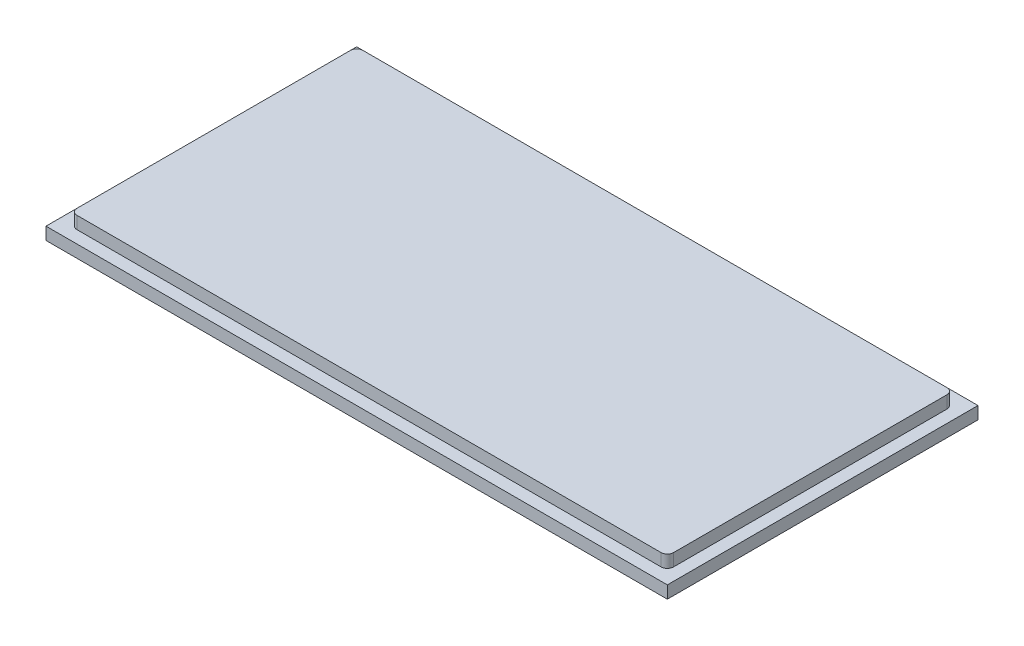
ISO-10303-21;
HEADER;
FILE_DESCRIPTION(('STEP AP214'),'2;1');
FILE_NAME('part.step','',(''),(''),'','','');
FILE_SCHEMA(('AUTOMOTIVE_DESIGN { 1 0 10303 214 1 1 1 1 }'));
ENDSEC;
DATA;
#1=APPLICATION_CONTEXT('core data for automotive mechanical design processes');
#2=APPLICATION_PROTOCOL_DEFINITION('international standard','automotive_design',2000,#1);
#3=PRODUCT_CONTEXT('',#1,'mechanical');
#4=PRODUCT('Part','Part','',(#3));
#5=PRODUCT_RELATED_PRODUCT_CATEGORY('part','',(#4));
#6=PRODUCT_DEFINITION_FORMATION('','',#4);
#7=PRODUCT_DEFINITION_CONTEXT('part definition',#1,'design');
#8=PRODUCT_DEFINITION('design','',#6,#7);
#9=PRODUCT_DEFINITION_SHAPE('','',#8);
#10=(LENGTH_UNIT() NAMED_UNIT(*) SI_UNIT(.MILLI.,.METRE.));
#11=(NAMED_UNIT(*) PLANE_ANGLE_UNIT() SI_UNIT($,.RADIAN.));
#12=(NAMED_UNIT(*) SI_UNIT($,.STERADIAN.) SOLID_ANGLE_UNIT());
#13=UNCERTAINTY_MEASURE_WITH_UNIT(LENGTH_MEASURE(1.E-05),#10,'distance_accuracy_value','');
#14=(GEOMETRIC_REPRESENTATION_CONTEXT(3) GLOBAL_UNCERTAINTY_ASSIGNED_CONTEXT((#13)) GLOBAL_UNIT_ASSIGNED_CONTEXT((#10,
#11,#12)) REPRESENTATION_CONTEXT('',''));
#15=CARTESIAN_POINT('',(0.,0.,0.));
#16=DIRECTION('',(0.,0.,1.));
#17=DIRECTION('',(1.,0.,0.));
#18=AXIS2_PLACEMENT_3D('',#15,#16,#17);
#19=CARTESIAN_POINT('',(0.,2.54,0.));
#20=DIRECTION('',(1.,0.,0.));
#21=DIRECTION('',(0.,0.,-1.));
#22=AXIS2_PLACEMENT_3D('',#19,#20,#21);
#23=PLANE('',#22);
#24=DIRECTION('',(0.,0.,1.));
#25=VECTOR('',#24,1.);
#26=CARTESIAN_POINT('',(0.,0.,0.));
#27=LINE('',#26,#25);
#28=CARTESIAN_POINT('',(0.,0.,-63.5));
#29=VERTEX_POINT('',#28);
#30=CARTESIAN_POINT('',(0.,0.,0.));
#31=VERTEX_POINT('',#30);
#32=EDGE_CURVE('E158',#29,#31,#27,.T.);
#33=ORIENTED_EDGE('',*,*,#32,.T.);
#34=DIRECTION('',(0.,-1.,0.));
#35=VECTOR('',#34,1.);
#36=CARTESIAN_POINT('',(0.,2.54,0.));
#37=LINE('',#36,#35);
#38=CARTESIAN_POINT('',(0.,2.54,0.));
#39=VERTEX_POINT('',#38);
#40=EDGE_CURVE('E11',#39,#31,#37,.T.);
#41=ORIENTED_EDGE('',*,*,#40,.F.);
#42=DIRECTION('',(0.,0.,1.));
#43=VECTOR('',#42,1.);
#44=CARTESIAN_POINT('',(0.,2.54,0.));
#45=LINE('',#44,#43);
#46=CARTESIAN_POINT('',(0.,2.54,-63.5));
#47=VERTEX_POINT('',#46);
#48=EDGE_CURVE('E169',#47,#39,#45,.T.);
#49=ORIENTED_EDGE('',*,*,#48,.F.);
#50=DIRECTION('',(0.,-1.,0.));
#51=VECTOR('',#50,1.);
#52=CARTESIAN_POINT('',(0.,2.54,-63.5));
#53=LINE('',#52,#51);
#54=EDGE_CURVE('E182',#47,#29,#53,.T.);
#55=ORIENTED_EDGE('',*,*,#54,.T.);
#56=EDGE_LOOP('',(#33,#41,#49,#55));
#57=FACE_BOUND('',#56,.T.);
#58=ADVANCED_FACE('F45',(#57),#23,.F.);
#59=CARTESIAN_POINT('',(0.,2.54,0.));
#60=DIRECTION('',(0.,0.,-1.));
#61=DIRECTION('',(-1.,0.,0.));
#62=AXIS2_PLACEMENT_3D('',#59,#60,#61);
#63=PLANE('',#62);
#64=DIRECTION('',(1.,0.,0.));
#65=VECTOR('',#64,1.);
#66=CARTESIAN_POINT('',(0.,0.,0.));
#67=LINE('',#66,#65);
#68=CARTESIAN_POINT('',(127.,0.,0.));
#69=VERTEX_POINT('',#68);
#70=EDGE_CURVE('E163',#31,#69,#67,.T.);
#71=ORIENTED_EDGE('',*,*,#70,.T.);
#72=DIRECTION('',(0.,-1.,0.));
#73=VECTOR('',#72,1.);
#74=CARTESIAN_POINT('',(127.,2.54,0.));
#75=LINE('',#74,#73);
#76=CARTESIAN_POINT('',(127.,2.54,0.));
#77=VERTEX_POINT('',#76);
#78=EDGE_CURVE('E53',#77,#69,#75,.T.);
#79=ORIENTED_EDGE('',*,*,#78,.F.);
#80=DIRECTION('',(1.,0.,0.));
#81=VECTOR('',#80,1.);
#82=CARTESIAN_POINT('',(0.,2.54,0.));
#83=LINE('',#82,#81);
#84=EDGE_CURVE('E173',#39,#77,#83,.T.);
#85=ORIENTED_EDGE('',*,*,#84,.F.);
#86=ORIENTED_EDGE('',*,*,#40,.T.);
#87=EDGE_LOOP('',(#71,#79,#85,#86));
#88=FACE_BOUND('',#87,.T.);
#89=ADVANCED_FACE('F219',(#88),#63,.F.);
#90=CARTESIAN_POINT('',(127.,2.54,0.));
#91=DIRECTION('',(-1.,0.,0.));
#92=DIRECTION('',(0.,0.,1.));
#93=AXIS2_PLACEMENT_3D('',#90,#91,#92);
#94=PLANE('',#93);
#95=DIRECTION('',(0.,0.,-1.));
#96=VECTOR('',#95,1.);
#97=CARTESIAN_POINT('',(127.,0.,0.));
#98=LINE('',#97,#96);
#99=CARTESIAN_POINT('',(127.,0.,-63.5));
#100=VERTEX_POINT('',#99);
#101=EDGE_CURVE('E186',#69,#100,#98,.T.);
#102=ORIENTED_EDGE('',*,*,#101,.T.);
#103=DIRECTION('',(0.,-1.,0.));
#104=VECTOR('',#103,1.);
#105=CARTESIAN_POINT('',(127.,2.54,-63.5));
#106=LINE('',#105,#104);
#107=CARTESIAN_POINT('',(127.,2.54,-63.5));
#108=VERTEX_POINT('',#107);
#109=EDGE_CURVE('E194',#108,#100,#106,.T.);
#110=ORIENTED_EDGE('',*,*,#109,.F.);
#111=DIRECTION('',(0.,0.,-1.));
#112=VECTOR('',#111,1.);
#113=CARTESIAN_POINT('',(127.,2.54,0.));
#114=LINE('',#113,#112);
#115=EDGE_CURVE('E177',#77,#108,#114,.T.);
#116=ORIENTED_EDGE('',*,*,#115,.F.);
#117=ORIENTED_EDGE('',*,*,#78,.T.);
#118=EDGE_LOOP('',(#102,#110,#116,#117));
#119=FACE_BOUND('',#118,.T.);
#120=ADVANCED_FACE('F203',(#119),#94,.F.);
#121=CARTESIAN_POINT('',(0.,2.54,-63.5));
#122=DIRECTION('',(0.,0.,1.));
#123=DIRECTION('',(1.,0.,0.));
#124=AXIS2_PLACEMENT_3D('',#121,#122,#123);
#125=PLANE('',#124);
#126=DIRECTION('',(-1.,0.,0.));
#127=VECTOR('',#126,1.);
#128=CARTESIAN_POINT('',(0.,0.,-63.5));
#129=LINE('',#128,#127);
#130=EDGE_CURVE('E174',#100,#29,#129,.T.);
#131=ORIENTED_EDGE('',*,*,#130,.T.);
#132=ORIENTED_EDGE('',*,*,#54,.F.);
#133=DIRECTION('',(-1.,0.,0.));
#134=VECTOR('',#133,1.);
#135=CARTESIAN_POINT('',(0.,2.54,-63.5));
#136=LINE('',#135,#134);
#137=EDGE_CURVE('E180',#108,#47,#136,.T.);
#138=ORIENTED_EDGE('',*,*,#137,.F.);
#139=ORIENTED_EDGE('',*,*,#109,.T.);
#140=EDGE_LOOP('',(#131,#132,#138,#139));
#141=FACE_BOUND('',#140,.T.);
#142=ADVANCED_FACE('F212',(#141),#125,.F.);
#143=CARTESIAN_POINT('',(0.,2.54,0.));
#144=DIRECTION('',(0.,-1.,0.));
#145=DIRECTION('',(0.,0.,-1.));
#146=AXIS2_PLACEMENT_3D('',#143,#144,#145);
#147=PLANE('',#146);
#148=DIRECTION('',(0.,0.,-1.));
#149=VECTOR('',#148,1.);
#150=CARTESIAN_POINT('',(124.46,2.54,0.));
#151=LINE('',#150,#149);
#152=CARTESIAN_POINT('',(124.46,2.54,-3.81000000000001));
#153=VERTEX_POINT('',#152);
#154=CARTESIAN_POINT('',(124.46,2.54,-59.69));
#155=VERTEX_POINT('',#154);
#156=EDGE_CURVE('E60',#153,#155,#151,.T.);
#157=ORIENTED_EDGE('',*,*,#156,.F.);
#158=CARTESIAN_POINT('',(123.19,2.54,-3.81));
#159=DIRECTION('',(0.,1.,0.));
#160=DIRECTION('',(0.,0.,1.));
#161=AXIS2_PLACEMENT_3D('',#158,#159,#160);
#162=CIRCLE('',#161,1.27);
#163=CARTESIAN_POINT('',(123.19,2.54,-2.54));
#164=VERTEX_POINT('',#163);
#165=EDGE_CURVE('E65',#153,#164,#162,.F.);
#166=ORIENTED_EDGE('',*,*,#165,.T.);
#167=DIRECTION('',(1.,0.,0.));
#168=VECTOR('',#167,1.);
#169=CARTESIAN_POINT('',(0.,2.54,-2.54));
#170=LINE('',#169,#168);
#171=CARTESIAN_POINT('',(3.81000000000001,2.54,-2.54));
#172=VERTEX_POINT('',#171);
#173=EDGE_CURVE('E385',#172,#164,#170,.T.);
#174=ORIENTED_EDGE('',*,*,#173,.F.);
#175=CARTESIAN_POINT('',(3.81,2.54,-3.81));
#176=DIRECTION('',(0.,1.,0.));
#177=DIRECTION('',(0.,0.,1.));
#178=AXIS2_PLACEMENT_3D('',#175,#176,#177);
#179=CIRCLE('',#178,1.27);
#180=CARTESIAN_POINT('',(2.54,2.54,-3.81000000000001));
#181=VERTEX_POINT('',#180);
#182=EDGE_CURVE('E388',#172,#181,#179,.F.);
#183=ORIENTED_EDGE('',*,*,#182,.T.);
#184=DIRECTION('',(0.,0.,-1.));
#185=VECTOR('',#184,1.);
#186=CARTESIAN_POINT('',(2.54,2.54,0.));
#187=LINE('',#186,#185);
#188=CARTESIAN_POINT('',(2.54,2.54,-59.69));
#189=VERTEX_POINT('',#188);
#190=EDGE_CURVE('E421',#181,#189,#187,.T.);
#191=ORIENTED_EDGE('',*,*,#190,.T.);
#192=CARTESIAN_POINT('',(3.81,2.54,-59.69));
#193=DIRECTION('',(0.,1.,0.));
#194=DIRECTION('',(0.,0.,1.));
#195=AXIS2_PLACEMENT_3D('',#192,#193,#194);
#196=CIRCLE('',#195,1.27);
#197=CARTESIAN_POINT('',(3.81000000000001,2.54,-60.96));
#198=VERTEX_POINT('',#197);
#199=EDGE_CURVE('E412',#189,#198,#196,.F.);
#200=ORIENTED_EDGE('',*,*,#199,.T.);
#201=DIRECTION('',(1.,0.,0.));
#202=VECTOR('',#201,1.);
#203=CARTESIAN_POINT('',(0.,2.54,-60.96));
#204=LINE('',#203,#202);
#205=CARTESIAN_POINT('',(123.19,2.54,-60.96));
#206=VERTEX_POINT('',#205);
#207=EDGE_CURVE('E415',#198,#206,#204,.T.);
#208=ORIENTED_EDGE('',*,*,#207,.T.);
#209=CARTESIAN_POINT('',(123.19,2.54,-59.69));
#210=DIRECTION('',(0.,1.,0.));
#211=DIRECTION('',(0.,0.,1.));
#212=AXIS2_PLACEMENT_3D('',#209,#210,#211);
#213=CIRCLE('',#212,1.27);
#214=EDGE_CURVE('E417',#155,#206,#213,.T.);
#215=ORIENTED_EDGE('',*,*,#214,.F.);
#216=EDGE_LOOP('',(#157,#166,#174,#183,#191,#200,#208,#215));
#217=FACE_BOUND('',#216,.T.);
#218=ORIENTED_EDGE('',*,*,#48,.T.);
#219=ORIENTED_EDGE('',*,*,#84,.T.);
#220=ORIENTED_EDGE('',*,*,#115,.T.);
#221=ORIENTED_EDGE('',*,*,#137,.T.);
#222=EDGE_LOOP('',(#218,#219,#220,#221));
#223=FACE_BOUND('',#222,.T.);
#224=ADVANCED_FACE('F218',(#217,#223),#147,.F.);
#225=CARTESIAN_POINT('',(0.,0.,0.));
#226=DIRECTION('',(0.,-1.,0.));
#227=DIRECTION('',(0.,0.,-1.));
#228=AXIS2_PLACEMENT_3D('',#225,#226,#227);
#229=PLANE('',#228);
#230=ORIENTED_EDGE('',*,*,#32,.F.);
#231=ORIENTED_EDGE('',*,*,#130,.F.);
#232=ORIENTED_EDGE('',*,*,#101,.F.);
#233=ORIENTED_EDGE('',*,*,#70,.F.);
#234=EDGE_LOOP('',(#230,#231,#232,#233));
#235=FACE_BOUND('',#234,.T.);
#236=ADVANCED_FACE('F209',(#235),#229,.T.);
#237=CARTESIAN_POINT('',(124.46,5.08,0.));
#238=DIRECTION('',(-1.,0.,0.));
#239=DIRECTION('',(0.,0.,1.));
#240=AXIS2_PLACEMENT_3D('',#237,#238,#239);
#241=PLANE('',#240);
#242=ORIENTED_EDGE('',*,*,#156,.T.);
#243=DIRECTION('',(0.,-1.,0.));
#244=VECTOR('',#243,1.);
#245=CARTESIAN_POINT('',(124.46,5.08,-59.69));
#246=LINE('',#245,#244);
#247=CARTESIAN_POINT('',(124.46,5.08,-59.69));
#248=VERTEX_POINT('',#247);
#249=EDGE_CURVE('E138',#248,#155,#246,.T.);
#250=ORIENTED_EDGE('',*,*,#249,.F.);
#251=DIRECTION('',(0.,0.,-1.));
#252=VECTOR('',#251,1.);
#253=CARTESIAN_POINT('',(124.46,5.08,0.));
#254=LINE('',#253,#252);
#255=CARTESIAN_POINT('',(124.46,5.08,-3.81000000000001));
#256=VERTEX_POINT('',#255);
#257=EDGE_CURVE('E146',#256,#248,#254,.T.);
#258=ORIENTED_EDGE('',*,*,#257,.F.);
#259=DIRECTION('',(0.,-1.,0.));
#260=VECTOR('',#259,1.);
#261=CARTESIAN_POINT('',(124.46,5.08,-3.81000000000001));
#262=LINE('',#261,#260);
#263=EDGE_CURVE('E380',#256,#153,#262,.T.);
#264=ORIENTED_EDGE('',*,*,#263,.T.);
#265=EDGE_LOOP('',(#242,#250,#258,#264));
#266=FACE_BOUND('',#265,.T.);
#267=ADVANCED_FACE('F156',(#266),#241,.F.);
#268=CARTESIAN_POINT('',(123.19,5.08,-59.69));
#269=DIRECTION('',(0.,-1.,0.));
#270=DIRECTION('',(0.,0.,-1.));
#271=AXIS2_PLACEMENT_3D('',#268,#269,#270);
#272=CYLINDRICAL_SURFACE('',#271,1.27);
#273=ORIENTED_EDGE('',*,*,#214,.T.);
#274=DIRECTION('',(0.,-1.,0.));
#275=VECTOR('',#274,1.);
#276=CARTESIAN_POINT('',(123.19,5.08,-60.96));
#277=LINE('',#276,#275);
#278=CARTESIAN_POINT('',(123.19,5.08,-60.96));
#279=VERTEX_POINT('',#278);
#280=EDGE_CURVE('E140',#279,#206,#277,.T.);
#281=ORIENTED_EDGE('',*,*,#280,.F.);
#282=CARTESIAN_POINT('',(123.19,5.08,-59.69));
#283=DIRECTION('',(0.,1.,0.));
#284=DIRECTION('',(0.,0.,1.));
#285=AXIS2_PLACEMENT_3D('',#282,#283,#284);
#286=CIRCLE('',#285,1.27);
#287=EDGE_CURVE('E133',#248,#279,#286,.T.);
#288=ORIENTED_EDGE('',*,*,#287,.F.);
#289=ORIENTED_EDGE('',*,*,#249,.T.);
#290=EDGE_LOOP('',(#273,#281,#288,#289));
#291=FACE_BOUND('',#290,.T.);
#292=ADVANCED_FACE('F136',(#291),#272,.T.);
#293=CARTESIAN_POINT('',(0.,5.08,-60.96));
#294=DIRECTION('',(0.,0.,-1.));
#295=DIRECTION('',(-1.,0.,0.));
#296=AXIS2_PLACEMENT_3D('',#293,#294,#295);
#297=PLANE('',#296);
#298=ORIENTED_EDGE('',*,*,#207,.F.);
#299=DIRECTION('',(0.,-1.,0.));
#300=VECTOR('',#299,1.);
#301=CARTESIAN_POINT('',(3.81000000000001,5.08,-60.96));
#302=LINE('',#301,#300);
#303=CARTESIAN_POINT('',(3.81000000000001,5.08,-60.96));
#304=VERTEX_POINT('',#303);
#305=EDGE_CURVE('E165',#304,#198,#302,.T.);
#306=ORIENTED_EDGE('',*,*,#305,.F.);
#307=DIRECTION('',(1.,0.,0.));
#308=VECTOR('',#307,1.);
#309=CARTESIAN_POINT('',(0.,5.08,-60.96));
#310=LINE('',#309,#308);
#311=EDGE_CURVE('E145',#304,#279,#310,.T.);
#312=ORIENTED_EDGE('',*,*,#311,.T.);
#313=ORIENTED_EDGE('',*,*,#280,.T.);
#314=EDGE_LOOP('',(#298,#306,#312,#313));
#315=FACE_BOUND('',#314,.T.);
#316=ADVANCED_FACE('F237',(#315),#297,.T.);
#317=CARTESIAN_POINT('',(3.81,5.08,-59.69));
#318=DIRECTION('',(0.,-1.,0.));
#319=DIRECTION('',(0.,0.,-1.));
#320=AXIS2_PLACEMENT_3D('',#317,#318,#319);
#321=CYLINDRICAL_SURFACE('',#320,1.27);
#322=ORIENTED_EDGE('',*,*,#199,.F.);
#323=DIRECTION('',(0.,-1.,0.));
#324=VECTOR('',#323,1.);
#325=CARTESIAN_POINT('',(2.54,5.08,-59.69));
#326=LINE('',#325,#324);
#327=CARTESIAN_POINT('',(2.54,5.08,-59.69));
#328=VERTEX_POINT('',#327);
#329=EDGE_CURVE('E404',#328,#189,#326,.T.);
#330=ORIENTED_EDGE('',*,*,#329,.F.);
#331=CARTESIAN_POINT('',(3.81,5.08,-59.69));
#332=DIRECTION('',(0.,1.,0.));
#333=DIRECTION('',(0.,0.,1.));
#334=AXIS2_PLACEMENT_3D('',#331,#332,#333);
#335=CIRCLE('',#334,1.27);
#336=EDGE_CURVE('E414',#328,#304,#335,.F.);
#337=ORIENTED_EDGE('',*,*,#336,.T.);
#338=ORIENTED_EDGE('',*,*,#305,.T.);
#339=EDGE_LOOP('',(#322,#330,#337,#338));
#340=FACE_BOUND('',#339,.T.);
#341=ADVANCED_FACE('F240',(#340),#321,.T.);
#342=CARTESIAN_POINT('',(2.54,5.08,0.));
#343=DIRECTION('',(-1.,0.,0.));
#344=DIRECTION('',(0.,0.,1.));
#345=AXIS2_PLACEMENT_3D('',#342,#343,#344);
#346=PLANE('',#345);
#347=ORIENTED_EDGE('',*,*,#190,.F.);
#348=DIRECTION('',(0.,-1.,0.));
#349=VECTOR('',#348,1.);
#350=CARTESIAN_POINT('',(2.54,5.08,-3.81000000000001));
#351=LINE('',#350,#349);
#352=CARTESIAN_POINT('',(2.54,5.08,-3.81000000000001));
#353=VERTEX_POINT('',#352);
#354=EDGE_CURVE('E400',#353,#181,#351,.T.);
#355=ORIENTED_EDGE('',*,*,#354,.F.);
#356=DIRECTION('',(0.,0.,-1.));
#357=VECTOR('',#356,1.);
#358=CARTESIAN_POINT('',(2.54,5.08,0.));
#359=LINE('',#358,#357);
#360=EDGE_CURVE('E435',#353,#328,#359,.T.);
#361=ORIENTED_EDGE('',*,*,#360,.T.);
#362=ORIENTED_EDGE('',*,*,#329,.T.);
#363=EDGE_LOOP('',(#347,#355,#361,#362));
#364=FACE_BOUND('',#363,.T.);
#365=ADVANCED_FACE('F244',(#364),#346,.T.);
#366=CARTESIAN_POINT('',(3.81,5.08,-3.81));
#367=DIRECTION('',(0.,-1.,0.));
#368=DIRECTION('',(0.,0.,-1.));
#369=AXIS2_PLACEMENT_3D('',#366,#367,#368);
#370=CYLINDRICAL_SURFACE('',#369,1.27);
#371=ORIENTED_EDGE('',*,*,#182,.F.);
#372=DIRECTION('',(0.,-1.,0.));
#373=VECTOR('',#372,1.);
#374=CARTESIAN_POINT('',(3.81000000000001,5.08,-2.54));
#375=LINE('',#374,#373);
#376=CARTESIAN_POINT('',(3.81000000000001,5.08,-2.54));
#377=VERTEX_POINT('',#376);
#378=EDGE_CURVE('E396',#377,#172,#375,.T.);
#379=ORIENTED_EDGE('',*,*,#378,.F.);
#380=CARTESIAN_POINT('',(3.81,5.08,-3.81));
#381=DIRECTION('',(0.,1.,0.));
#382=DIRECTION('',(0.,0.,1.));
#383=AXIS2_PLACEMENT_3D('',#380,#381,#382);
#384=CIRCLE('',#383,1.27);
#385=EDGE_CURVE('E432',#377,#353,#384,.F.);
#386=ORIENTED_EDGE('',*,*,#385,.T.);
#387=ORIENTED_EDGE('',*,*,#354,.T.);
#388=EDGE_LOOP('',(#371,#379,#386,#387));
#389=FACE_BOUND('',#388,.T.);
#390=ADVANCED_FACE('F248',(#389),#370,.T.);
#391=CARTESIAN_POINT('',(0.,5.08,-2.54));
#392=DIRECTION('',(0.,0.,-1.));
#393=DIRECTION('',(-1.,0.,0.));
#394=AXIS2_PLACEMENT_3D('',#391,#392,#393);
#395=PLANE('',#394);
#396=ORIENTED_EDGE('',*,*,#173,.T.);
#397=DIRECTION('',(0.,-1.,0.));
#398=VECTOR('',#397,1.);
#399=CARTESIAN_POINT('',(123.19,5.08,-2.54));
#400=LINE('',#399,#398);
#401=CARTESIAN_POINT('',(123.19,5.08,-2.54));
#402=VERTEX_POINT('',#401);
#403=EDGE_CURVE('E382',#402,#164,#400,.T.);
#404=ORIENTED_EDGE('',*,*,#403,.F.);
#405=DIRECTION('',(1.,0.,0.));
#406=VECTOR('',#405,1.);
#407=CARTESIAN_POINT('',(0.,5.08,-2.54));
#408=LINE('',#407,#406);
#409=EDGE_CURVE('E445',#377,#402,#408,.T.);
#410=ORIENTED_EDGE('',*,*,#409,.F.);
#411=ORIENTED_EDGE('',*,*,#378,.T.);
#412=EDGE_LOOP('',(#396,#404,#410,#411));
#413=FACE_BOUND('',#412,.T.);
#414=ADVANCED_FACE('F252',(#413),#395,.F.);
#415=CARTESIAN_POINT('',(123.19,5.08,-3.81));
#416=DIRECTION('',(0.,-1.,0.));
#417=DIRECTION('',(0.,0.,-1.));
#418=AXIS2_PLACEMENT_3D('',#415,#416,#417);
#419=CYLINDRICAL_SURFACE('',#418,1.27);
#420=ORIENTED_EDGE('',*,*,#165,.F.);
#421=ORIENTED_EDGE('',*,*,#263,.F.);
#422=CARTESIAN_POINT('',(123.19,5.08,-3.81));
#423=DIRECTION('',(0.,1.,0.));
#424=DIRECTION('',(0.,0.,1.));
#425=AXIS2_PLACEMENT_3D('',#422,#423,#424);
#426=CIRCLE('',#425,1.27);
#427=EDGE_CURVE('E152',#256,#402,#426,.F.);
#428=ORIENTED_EDGE('',*,*,#427,.T.);
#429=ORIENTED_EDGE('',*,*,#403,.T.);
#430=EDGE_LOOP('',(#420,#421,#428,#429));
#431=FACE_BOUND('',#430,.T.);
#432=ADVANCED_FACE('F256',(#431),#419,.T.);
#433=CARTESIAN_POINT('',(0.,5.08,0.));
#434=DIRECTION('',(0.,1.,0.));
#435=DIRECTION('',(0.,0.,1.));
#436=AXIS2_PLACEMENT_3D('',#433,#434,#435);
#437=PLANE('',#436);
#438=ORIENTED_EDGE('',*,*,#257,.T.);
#439=ORIENTED_EDGE('',*,*,#287,.T.);
#440=ORIENTED_EDGE('',*,*,#311,.F.);
#441=ORIENTED_EDGE('',*,*,#336,.F.);
#442=ORIENTED_EDGE('',*,*,#360,.F.);
#443=ORIENTED_EDGE('',*,*,#385,.F.);
#444=ORIENTED_EDGE('',*,*,#409,.T.);
#445=ORIENTED_EDGE('',*,*,#427,.F.);
#446=EDGE_LOOP('',(#438,#439,#440,#441,#442,#443,#444,#445));
#447=FACE_BOUND('',#446,.T.);
#448=ADVANCED_FACE('F150',(#447),#437,.T.);
#449=CLOSED_SHELL('',(#58,#89,#120,#142,#224,#236,#267,#292,#316,#341,#365,#390,#414,#432,#448));
#450=MANIFOLD_SOLID_BREP('B2',#449);
#451=ADVANCED_BREP_SHAPE_REPRESENTATION('',(#18,#450),#14);
#452=SHAPE_DEFINITION_REPRESENTATION(#9,#451);
ENDSEC;
END-ISO-10303-21;
